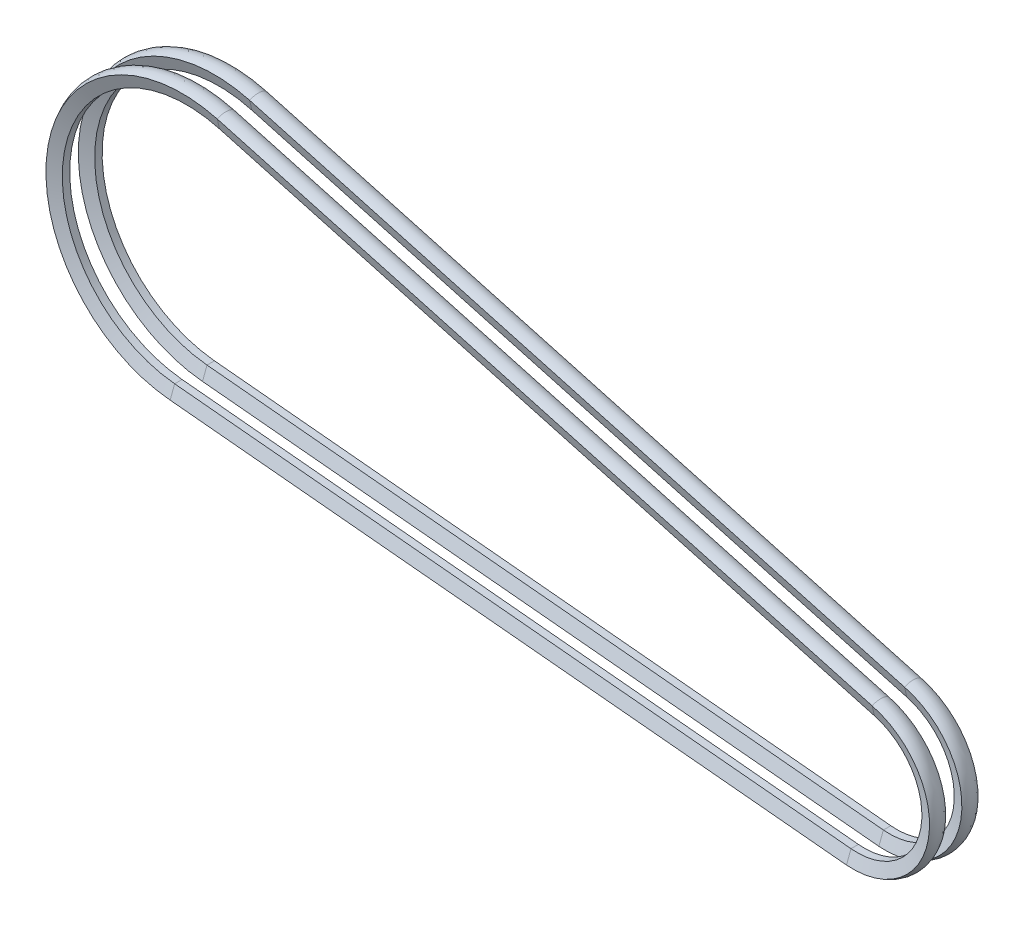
ISO-10303-21;
HEADER;
FILE_DESCRIPTION(('STEP AP214'),'2;1');
FILE_NAME('part.step','',(''),(''),'','','');
FILE_SCHEMA(('AUTOMOTIVE_DESIGN { 1 0 10303 214 1 1 1 1 }'));
ENDSEC;
DATA;
#1=APPLICATION_CONTEXT('core data for automotive mechanical design processes');
#2=APPLICATION_PROTOCOL_DEFINITION('international standard','automotive_design',2000,#1);
#3=PRODUCT_CONTEXT('',#1,'mechanical');
#4=PRODUCT('Part','Part','',(#3));
#5=PRODUCT_RELATED_PRODUCT_CATEGORY('part','',(#4));
#6=PRODUCT_DEFINITION_FORMATION('','',#4);
#7=PRODUCT_DEFINITION_CONTEXT('part definition',#1,'design');
#8=PRODUCT_DEFINITION('design','',#6,#7);
#9=PRODUCT_DEFINITION_SHAPE('','',#8);
#10=(LENGTH_UNIT() NAMED_UNIT(*) SI_UNIT(.MILLI.,.METRE.));
#11=(NAMED_UNIT(*) PLANE_ANGLE_UNIT() SI_UNIT($,.RADIAN.));
#12=(NAMED_UNIT(*) SI_UNIT($,.STERADIAN.) SOLID_ANGLE_UNIT());
#13=UNCERTAINTY_MEASURE_WITH_UNIT(LENGTH_MEASURE(1.E-05),#10,'distance_accuracy_value','');
#14=(GEOMETRIC_REPRESENTATION_CONTEXT(3) GLOBAL_UNCERTAINTY_ASSIGNED_CONTEXT((#13)) GLOBAL_UNIT_ASSIGNED_CONTEXT((#10,
#11,#12)) REPRESENTATION_CONTEXT('',''));
#15=CARTESIAN_POINT('',(0.,0.,0.));
#16=DIRECTION('',(0.,0.,1.));
#17=DIRECTION('',(1.,0.,0.));
#18=AXIS2_PLACEMENT_3D('',#15,#16,#17);
#19=DIRECTION('',(0.00737041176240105,0.939663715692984,0.342020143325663));
#20=VECTOR('',#19,1.);
#21=CARTESIAN_POINT('',(-6.19056546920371,-75.6646933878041,-24.0313623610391));
#22=LINE('',#21,#20);
#23=CARTESIAN_POINT('',(0.,0.,0.));
#24=DIRECTION('',(0.,0.,1.));
#25=AXIS1_PLACEMENT('',#23,#24);
#26=SURFACE_OF_REVOLUTION('',#22,#25);
#27=CARTESIAN_POINT('',(-6.19056546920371,-75.6646933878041,-24.0313623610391));
#28=VERTEX_POINT('',#27);
#29=CARTESIAN_POINT('',(-6.0971796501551,-63.7588096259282,-19.6978417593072));
#30=VERTEX_POINT('',#29);
#31=EDGE_CURVE('P0_E176',#28,#30,#22,.T.);
#32=ORIENTED_EDGE('',*,*,#31,.T.);
#33=CARTESIAN_POINT('',(0.,0.,-19.6978417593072));
#34=DIRECTION('',(0.,0.,1.));
#35=DIRECTION('',(1.,0.,0.));
#36=AXIS2_PLACEMENT_3D('',#33,#34,#35);
#37=CIRCLE('',#36,64.0496791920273);
#38=CARTESIAN_POINT('',(17.06330276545,61.7349585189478,-19.6978417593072));
#39=VERTEX_POINT('',#38);
#40=EDGE_CURVE('P0_E26',#30,#39,#37,.T.);
#41=ORIENTED_EDGE('',*,*,#40,.T.);
#42=DIRECTION('',(-0.170236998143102,-0.92414370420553,0.342020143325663));
#43=VECTOR('',#42,1.);
#44=CARTESIAN_POINT('',(19.2202679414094,73.4441980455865,-24.0313623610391));
#45=LINE('',#44,#43);
#46=CARTESIAN_POINT('',(19.2202679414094,73.4441980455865,-24.0313623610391));
#47=VERTEX_POINT('',#46);
#48=EDGE_CURVE('P0_E146',#47,#39,#45,.T.);
#49=ORIENTED_EDGE('',*,*,#48,.F.);
#50=CARTESIAN_POINT('',(0.,0.,-24.0313623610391));
#51=DIRECTION('',(0.,0.,1.));
#52=DIRECTION('',(1.,0.,0.));
#53=AXIS2_PLACEMENT_3D('',#50,#51,#52);
#54=CIRCLE('',#53,75.9175139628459);
#55=EDGE_CURVE('P0_E11',#28,#47,#54,.T.);
#56=ORIENTED_EDGE('',*,*,#55,.F.);
#57=EDGE_LOOP('',(#32,#41,#49,#56));
#58=FACE_BOUND('',#57,.T.);
#59=ADVANCED_FACE('P0_F17',(#58),#26,.F.);
#60=CARTESIAN_POINT('',(0.,0.,0.));
#61=DIRECTION('',(0.,0.,1.));
#62=DIRECTION('',(1.,0.,0.));
#63=AXIS2_PLACEMENT_3D('',#60,#61,#62);
#64=CYLINDRICAL_SURFACE('',#63,64.0496791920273);
#65=DIRECTION('',(0.,0.,1.));
#66=VECTOR('',#65,1.);
#67=CARTESIAN_POINT('',(-6.0971796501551,-63.7588096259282,-19.6978417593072));
#68=LINE('',#67,#66);
#69=CARTESIAN_POINT('',(-6.0971796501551,-63.7588096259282,-12.3439747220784));
#70=VERTEX_POINT('',#69);
#71=EDGE_CURVE('P0_E158',#30,#70,#68,.T.);
#72=ORIENTED_EDGE('',*,*,#71,.T.);
#73=CARTESIAN_POINT('',(0.,0.,-12.3439747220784));
#74=DIRECTION('',(0.,0.,1.));
#75=DIRECTION('',(1.,0.,0.));
#76=AXIS2_PLACEMENT_3D('',#73,#74,#75);
#77=CIRCLE('',#76,64.0496791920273);
#78=CARTESIAN_POINT('',(17.06330276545,61.7349585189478,-12.3439747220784));
#79=VERTEX_POINT('',#78);
#80=EDGE_CURVE('P0_E152',#70,#79,#77,.T.);
#81=ORIENTED_EDGE('',*,*,#80,.T.);
#82=DIRECTION('',(0.,0.,1.));
#83=VECTOR('',#82,1.);
#84=CARTESIAN_POINT('',(17.06330276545,61.7349585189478,-19.6978417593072));
#85=LINE('',#84,#83);
#86=EDGE_CURVE('P0_E141',#39,#79,#85,.T.);
#87=ORIENTED_EDGE('',*,*,#86,.F.);
#88=ORIENTED_EDGE('',*,*,#40,.F.);
#89=EDGE_LOOP('',(#72,#81,#87,#88));
#90=FACE_BOUND('',#89,.T.);
#91=ADVANCED_FACE('P0_F156',(#90),#64,.F.);
#92=DIRECTION('',(-0.00737041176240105,-0.939663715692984,0.342020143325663));
#93=VECTOR('',#92,1.);
#94=CARTESIAN_POINT('',(-6.0971796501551,-63.7588096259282,-12.3439747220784));
#95=LINE('',#94,#93);
#96=CARTESIAN_POINT('',(0.,0.,0.));
#97=DIRECTION('',(0.,0.,1.));
#98=AXIS1_PLACEMENT('',#96,#97);
#99=SURFACE_OF_REVOLUTION('',#95,#98);
#100=CARTESIAN_POINT('',(-6.19056546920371,-75.6646933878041,-8.01045412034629));
#101=VERTEX_POINT('',#100);
#102=EDGE_CURVE('P0_E181',#70,#101,#95,.T.);
#103=ORIENTED_EDGE('',*,*,#102,.T.);
#104=CARTESIAN_POINT('',(0.,0.,-8.01045412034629));
#105=DIRECTION('',(0.,0.,1.));
#106=DIRECTION('',(1.,0.,0.));
#107=AXIS2_PLACEMENT_3D('',#104,#105,#106);
#108=CIRCLE('',#107,75.9175139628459);
#109=CARTESIAN_POINT('',(19.2202679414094,73.4441980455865,-8.01045412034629));
#110=VERTEX_POINT('',#109);
#111=EDGE_CURVE('P0_E154',#101,#110,#108,.T.);
#112=ORIENTED_EDGE('',*,*,#111,.T.);
#113=DIRECTION('',(0.170236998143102,0.92414370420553,0.342020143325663));
#114=VECTOR('',#113,1.);
#115=CARTESIAN_POINT('',(17.06330276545,61.7349585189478,-12.3439747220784));
#116=LINE('',#115,#114);
#117=EDGE_CURVE('P0_E139',#79,#110,#116,.T.);
#118=ORIENTED_EDGE('',*,*,#117,.F.);
#119=ORIENTED_EDGE('',*,*,#80,.F.);
#120=EDGE_LOOP('',(#103,#112,#118,#119));
#121=FACE_BOUND('',#120,.T.);
#122=ADVANCED_FACE('P0_F151',(#121),#99,.F.);
#123=CARTESIAN_POINT('',(-6.0971796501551,-63.7588096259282,-16.0209082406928));
#124=DIRECTION('',(0.999969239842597,-0.00784342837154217,0.));
#125=DIRECTION('',(-0.00784342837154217,-0.999969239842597,0.));
#126=AXIS2_PLACEMENT_3D('',#123,#124,#125);
#127=CIRCLE('',#126,14.3501276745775);
#128=CARTESIAN_POINT('',(0.,0.,0.));
#129=DIRECTION('',(0.,0.,1.));
#130=AXIS1_PLACEMENT('',#128,#129);
#131=SURFACE_OF_REVOLUTION('',#127,#130);
#132=EDGE_CURVE('P0_E97',#101,#28,#127,.T.);
#133=ORIENTED_EDGE('',*,*,#132,.T.);
#134=ORIENTED_EDGE('',*,*,#55,.T.);
#135=CARTESIAN_POINT('',(17.06330276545,61.7349585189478,-16.0209082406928));
#136=DIRECTION('',(-0.983453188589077,0.181162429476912,0.));
#137=DIRECTION('',(0.181162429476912,0.983453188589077,0.));
#138=AXIS2_PLACEMENT_3D('',#135,#136,#137);
#139=CIRCLE('',#138,14.3501276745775);
#140=EDGE_CURVE('P0_E113',#110,#47,#139,.T.);
#141=ORIENTED_EDGE('',*,*,#140,.F.);
#142=ORIENTED_EDGE('',*,*,#111,.F.);
#143=EDGE_LOOP('',(#133,#134,#141,#142));
#144=FACE_BOUND('',#143,.T.);
#145=ADVANCED_FACE('P0_F188',(#144),#131,.F.);
#146=CARTESIAN_POINT('',(-675.337583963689,-11.8998067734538,-24.0313623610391));
#147=DIRECTION('',(0.0325541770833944,0.341622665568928,-0.939273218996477));
#148=DIRECTION('',(0.,0.939771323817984,0.341803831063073));
#149=AXIS2_PLACEMENT_3D('',#146,#147,#148);
#150=PLANE('',#149);
#151=DIRECTION('',(0.00737041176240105,0.939663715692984,0.342020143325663));
#152=VECTOR('',#151,1.);
#153=CARTESIAN_POINT('',(-675.337583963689,-11.8998067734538,-24.0313623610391));
#154=LINE('',#153,#152);
#155=CARTESIAN_POINT('',(-675.337583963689,-11.8998067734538,-24.0313623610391));
#156=VERTEX_POINT('',#155);
#157=CARTESIAN_POINT('',(-675.24419814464,0.00607698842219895,-19.6978417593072));
#158=VERTEX_POINT('',#157);
#159=EDGE_CURVE('P0_E94',#156,#158,#154,.T.);
#160=ORIENTED_EDGE('',*,*,#159,.T.);
#161=DIRECTION('',(0.995490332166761,-0.0948630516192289,0.));
#162=VECTOR('',#161,1.);
#163=CARTESIAN_POINT('',(-675.24419814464,0.00607698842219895,-19.6978417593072));
#164=LINE('',#163,#162);
#165=EDGE_CURVE('P0_E168',#158,#30,#164,.T.);
#166=ORIENTED_EDGE('',*,*,#165,.T.);
#167=ORIENTED_EDGE('',*,*,#31,.F.);
#168=DIRECTION('',(0.995490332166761,-0.0948630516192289,0.));
#169=VECTOR('',#168,1.);
#170=CARTESIAN_POINT('',(-675.337583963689,-11.8998067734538,-24.0313623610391));
#171=LINE('',#170,#169);
#172=EDGE_CURVE('P0_E165',#156,#28,#171,.T.);
#173=ORIENTED_EDGE('',*,*,#172,.F.);
#174=EDGE_LOOP('',(#160,#166,#167,#173));
#175=FACE_BOUND('',#174,.T.);
#176=ADVANCED_FACE('P0_F206',(#175),#150,.T.);
#177=CARTESIAN_POINT('',(-675.24419814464,0.00607698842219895,-19.6978417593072));
#178=DIRECTION('',(0.0948630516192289,0.995490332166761,0.));
#179=DIRECTION('',(-0.995490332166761,0.0948630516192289,0.));
#180=AXIS2_PLACEMENT_3D('',#177,#178,#179);
#181=PLANE('',#180);
#182=DIRECTION('',(0.,0.,1.));
#183=VECTOR('',#182,1.);
#184=CARTESIAN_POINT('',(-675.24419814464,0.00607698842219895,-19.6978417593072));
#185=LINE('',#184,#183);
#186=CARTESIAN_POINT('',(-675.24419814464,0.00607698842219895,-12.3439747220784));
#187=VERTEX_POINT('',#186);
#188=EDGE_CURVE('P0_E208',#158,#187,#185,.T.);
#189=ORIENTED_EDGE('',*,*,#188,.T.);
#190=DIRECTION('',(0.995490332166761,-0.0948630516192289,0.));
#191=VECTOR('',#190,1.);
#192=CARTESIAN_POINT('',(-675.24419814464,0.00607698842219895,-12.3439747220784));
#193=LINE('',#192,#191);
#194=EDGE_CURVE('P0_E171',#187,#70,#193,.T.);
#195=ORIENTED_EDGE('',*,*,#194,.T.);
#196=ORIENTED_EDGE('',*,*,#71,.F.);
#197=ORIENTED_EDGE('',*,*,#165,.F.);
#198=EDGE_LOOP('',(#189,#195,#196,#197));
#199=FACE_BOUND('',#198,.T.);
#200=ADVANCED_FACE('P0_F205',(#199),#181,.T.);
#201=CARTESIAN_POINT('',(-675.24419814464,0.00607698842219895,-12.3439747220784));
#202=DIRECTION('',(0.0325541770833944,0.341622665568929,0.939273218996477));
#203=DIRECTION('',(0.,-0.939771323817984,0.341803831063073));
#204=AXIS2_PLACEMENT_3D('',#201,#202,#203);
#205=PLANE('',#204);
#206=DIRECTION('',(-0.00737041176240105,-0.939663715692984,0.342020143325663));
#207=VECTOR('',#206,1.);
#208=CARTESIAN_POINT('',(-675.24419814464,0.00607698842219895,-12.3439747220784));
#209=LINE('',#208,#207);
#210=CARTESIAN_POINT('',(-675.337583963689,-11.8998067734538,-8.01045412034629));
#211=VERTEX_POINT('',#210);
#212=EDGE_CURVE('P0_E118',#187,#211,#209,.T.);
#213=ORIENTED_EDGE('',*,*,#212,.T.);
#214=DIRECTION('',(0.995490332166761,-0.0948630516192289,0.));
#215=VECTOR('',#214,1.);
#216=CARTESIAN_POINT('',(-675.337583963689,-11.8998067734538,-8.01045412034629));
#217=LINE('',#216,#215);
#218=EDGE_CURVE('P0_E174',#211,#101,#217,.T.);
#219=ORIENTED_EDGE('',*,*,#218,.T.);
#220=ORIENTED_EDGE('',*,*,#102,.F.);
#221=ORIENTED_EDGE('',*,*,#194,.F.);
#222=EDGE_LOOP('',(#213,#219,#220,#221));
#223=FACE_BOUND('',#222,.T.);
#224=ADVANCED_FACE('P0_F231',(#223),#205,.T.);
#225=CARTESIAN_POINT('',(-675.24419814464,0.00607698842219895,-16.0209082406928));
#226=DIRECTION('',(0.999969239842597,-0.00784342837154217,0.));
#227=DIRECTION('',(-0.00784342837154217,-0.999969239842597,0.));
#228=AXIS2_PLACEMENT_3D('',#225,#226,#227);
#229=CIRCLE('',#228,14.3501276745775);
#230=DIRECTION('',(0.995490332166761,-0.0948630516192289,0.));
#231=VECTOR('',#230,1.);
#232=SURFACE_OF_LINEAR_EXTRUSION('',#229,#231);
#233=EDGE_CURVE('P0_E115',#211,#156,#229,.T.);
#234=ORIENTED_EDGE('',*,*,#233,.T.);
#235=ORIENTED_EDGE('',*,*,#172,.T.);
#236=ORIENTED_EDGE('',*,*,#132,.F.);
#237=ORIENTED_EDGE('',*,*,#218,.F.);
#238=EDGE_LOOP('',(#234,#235,#236,#237));
#239=FACE_BOUND('',#238,.T.);
#240=ADVANCED_FACE('P0_F227',(#239),#232,.T.);
#241=DIRECTION('',(-0.170236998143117,-0.924143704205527,0.342020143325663));
#242=VECTOR('',#241,1.);
#243=CARTESIAN_POINT('',(-628.725485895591,252.301664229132,-24.0313623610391));
#244=LINE('',#243,#242);
#245=CARTESIAN_POINT('',(-663.575000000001,122.237499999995,0.));
#246=DIRECTION('',(0.,0.,1.));
#247=AXIS1_PLACEMENT('',#245,#246);
#248=SURFACE_OF_REVOLUTION('',#244,#247);
#249=CARTESIAN_POINT('',(-628.725485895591,252.301664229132,-24.0313623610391));
#250=VERTEX_POINT('',#249);
#251=CARTESIAN_POINT('',(-630.882451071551,240.592424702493,-19.6978417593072));
#252=VERTEX_POINT('',#251);
#253=EDGE_CURVE('P0_E92',#250,#252,#244,.T.);
#254=ORIENTED_EDGE('',*,*,#253,.T.);
#255=CARTESIAN_POINT('',(-663.575000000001,122.237499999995,-19.6978417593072));
#256=DIRECTION('',(0.,0.,1.));
#257=DIRECTION('',(1.,0.,0.));
#258=AXIS2_PLACEMENT_3D('',#255,#256,#257);
#259=CIRCLE('',#258,122.787177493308);
#260=EDGE_CURVE('P0_E98',#252,#158,#259,.T.);
#261=ORIENTED_EDGE('',*,*,#260,.T.);
#262=ORIENTED_EDGE('',*,*,#159,.F.);
#263=CARTESIAN_POINT('',(-663.575000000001,122.237499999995,-24.0313623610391));
#264=DIRECTION('',(0.,0.,1.));
#265=DIRECTION('',(1.,0.,0.));
#266=AXIS2_PLACEMENT_3D('',#263,#264,#265);
#267=CIRCLE('',#266,134.65205327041);
#268=EDGE_CURVE('P0_E88',#250,#156,#267,.T.);
#269=ORIENTED_EDGE('',*,*,#268,.F.);
#270=EDGE_LOOP('',(#254,#261,#262,#269));
#271=FACE_BOUND('',#270,.T.);
#272=ADVANCED_FACE('P0_F90',(#271),#248,.F.);
#273=CARTESIAN_POINT('',(-663.575000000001,122.237499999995,0.));
#274=DIRECTION('',(0.,0.,1.));
#275=DIRECTION('',(1.,0.,0.));
#276=AXIS2_PLACEMENT_3D('',#273,#274,#275);
#277=CYLINDRICAL_SURFACE('',#276,122.787177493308);
#278=DIRECTION('',(0.,0.,1.));
#279=VECTOR('',#278,1.);
#280=CARTESIAN_POINT('',(-630.882451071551,240.592424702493,-19.6978417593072));
#281=LINE('',#280,#279);
#282=CARTESIAN_POINT('',(-630.882451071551,240.592424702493,-12.3439747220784));
#283=VERTEX_POINT('',#282);
#284=EDGE_CURVE('P0_E109',#252,#283,#281,.T.);
#285=ORIENTED_EDGE('',*,*,#284,.T.);
#286=CARTESIAN_POINT('',(-663.575000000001,122.237499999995,-12.3439747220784));
#287=DIRECTION('',(0.,0.,1.));
#288=DIRECTION('',(1.,0.,0.));
#289=AXIS2_PLACEMENT_3D('',#286,#287,#288);
#290=CIRCLE('',#289,122.787177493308);
#291=EDGE_CURVE('P0_E214',#283,#187,#290,.T.);
#292=ORIENTED_EDGE('',*,*,#291,.T.);
#293=ORIENTED_EDGE('',*,*,#188,.F.);
#294=ORIENTED_EDGE('',*,*,#260,.F.);
#295=EDGE_LOOP('',(#285,#292,#293,#294));
#296=FACE_BOUND('',#295,.T.);
#297=ADVANCED_FACE('P0_F213',(#296),#277,.F.);
#298=DIRECTION('',(0.170236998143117,0.924143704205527,0.342020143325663));
#299=VECTOR('',#298,1.);
#300=CARTESIAN_POINT('',(-630.882451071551,240.592424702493,-12.3439747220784));
#301=LINE('',#300,#299);
#302=CARTESIAN_POINT('',(-663.575000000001,122.237499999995,0.));
#303=DIRECTION('',(0.,0.,1.));
#304=AXIS1_PLACEMENT('',#302,#303);
#305=SURFACE_OF_REVOLUTION('',#301,#304);
#306=CARTESIAN_POINT('',(-628.725485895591,252.301664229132,-8.01045412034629));
#307=VERTEX_POINT('',#306);
#308=EDGE_CURVE('P0_E128',#283,#307,#301,.T.);
#309=ORIENTED_EDGE('',*,*,#308,.T.);
#310=CARTESIAN_POINT('',(-663.575000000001,122.237499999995,-8.01045412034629));
#311=DIRECTION('',(0.,0.,1.));
#312=DIRECTION('',(1.,0.,0.));
#313=AXIS2_PLACEMENT_3D('',#310,#311,#312);
#314=CIRCLE('',#313,134.65205327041);
#315=EDGE_CURVE('P0_E104',#307,#211,#314,.T.);
#316=ORIENTED_EDGE('',*,*,#315,.T.);
#317=ORIENTED_EDGE('',*,*,#212,.F.);
#318=ORIENTED_EDGE('',*,*,#291,.F.);
#319=EDGE_LOOP('',(#309,#316,#317,#318));
#320=FACE_BOUND('',#319,.T.);
#321=ADVANCED_FACE('P0_F249',(#320),#305,.F.);
#322=CARTESIAN_POINT('',(-630.882451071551,240.592424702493,-16.0209082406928));
#323=DIRECTION('',(-0.983453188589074,0.181162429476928,0.));
#324=DIRECTION('',(0.181162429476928,0.983453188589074,0.));
#325=AXIS2_PLACEMENT_3D('',#322,#323,#324);
#326=CIRCLE('',#325,14.3501276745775);
#327=CARTESIAN_POINT('',(-663.575000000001,122.237499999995,0.));
#328=DIRECTION('',(0.,0.,1.));
#329=AXIS1_PLACEMENT('',#327,#328);
#330=SURFACE_OF_REVOLUTION('',#326,#329);
#331=EDGE_CURVE('P0_E101',#307,#250,#326,.T.);
#332=ORIENTED_EDGE('',*,*,#331,.T.);
#333=ORIENTED_EDGE('',*,*,#268,.T.);
#334=ORIENTED_EDGE('',*,*,#233,.F.);
#335=ORIENTED_EDGE('',*,*,#315,.F.);
#336=EDGE_LOOP('',(#332,#333,#334,#335));
#337=FACE_BOUND('',#336,.T.);
#338=ADVANCED_FACE('P0_F102',(#337),#330,.F.);
#339=DIRECTION('',(0.963949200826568,-0.266086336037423,0.));
#340=VECTOR('',#339,1.);
#341=SURFACE_OF_LINEAR_EXTRUSION('',#326,#340);
#342=DIRECTION('',(0.963949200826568,-0.266086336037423,0.));
#343=VECTOR('',#342,1.);
#344=CARTESIAN_POINT('',(-628.725485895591,252.301664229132,-8.01045412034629));
#345=LINE('',#344,#343);
#346=EDGE_CURVE('P0_E126',#307,#110,#345,.T.);
#347=ORIENTED_EDGE('',*,*,#346,.T.);
#348=ORIENTED_EDGE('',*,*,#140,.T.);
#349=DIRECTION('',(0.963949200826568,-0.266086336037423,0.));
#350=VECTOR('',#349,1.);
#351=CARTESIAN_POINT('',(-628.725485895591,252.301664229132,-24.0313623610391));
#352=LINE('',#351,#350);
#353=EDGE_CURVE('P0_E34',#250,#47,#352,.T.);
#354=ORIENTED_EDGE('',*,*,#353,.F.);
#355=ORIENTED_EDGE('',*,*,#331,.F.);
#356=EDGE_LOOP('',(#347,#348,#354,#355));
#357=FACE_BOUND('',#356,.T.);
#358=ADVANCED_FACE('P0_F111',(#357),#341,.F.);
#359=CARTESIAN_POINT('',(-628.725485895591,252.301664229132,-24.0313623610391));
#360=DIRECTION('',(0.0913129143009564,0.33079868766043,0.939273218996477));
#361=DIRECTION('',(0.,-0.943213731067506,0.332186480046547));
#362=AXIS2_PLACEMENT_3D('',#359,#360,#361);
#363=PLANE('',#362);
#364=ORIENTED_EDGE('',*,*,#353,.T.);
#365=ORIENTED_EDGE('',*,*,#48,.T.);
#366=DIRECTION('',(0.963949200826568,-0.266086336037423,0.));
#367=VECTOR('',#366,1.);
#368=CARTESIAN_POINT('',(-630.882451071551,240.592424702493,-19.6978417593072));
#369=LINE('',#368,#367);
#370=EDGE_CURVE('P0_E42',#252,#39,#369,.T.);
#371=ORIENTED_EDGE('',*,*,#370,.F.);
#372=ORIENTED_EDGE('',*,*,#253,.F.);
#373=EDGE_LOOP('',(#364,#365,#371,#372));
#374=FACE_BOUND('',#373,.T.);
#375=ADVANCED_FACE('P0_F108',(#374),#363,.F.);
#376=CARTESIAN_POINT('',(-630.882451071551,240.592424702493,-19.6978417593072));
#377=DIRECTION('',(0.266086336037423,0.963949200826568,0.));
#378=DIRECTION('',(-0.963949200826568,0.266086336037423,0.));
#379=AXIS2_PLACEMENT_3D('',#376,#377,#378);
#380=PLANE('',#379);
#381=ORIENTED_EDGE('',*,*,#370,.T.);
#382=ORIENTED_EDGE('',*,*,#86,.T.);
#383=DIRECTION('',(0.963949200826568,-0.266086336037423,0.));
#384=VECTOR('',#383,1.);
#385=CARTESIAN_POINT('',(-630.882451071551,240.592424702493,-12.3439747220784));
#386=LINE('',#385,#384);
#387=EDGE_CURVE('P0_E120',#283,#79,#386,.T.);
#388=ORIENTED_EDGE('',*,*,#387,.F.);
#389=ORIENTED_EDGE('',*,*,#284,.F.);
#390=EDGE_LOOP('',(#381,#382,#388,#389));
#391=FACE_BOUND('',#390,.T.);
#392=ADVANCED_FACE('P0_F142',(#391),#380,.F.);
#393=CARTESIAN_POINT('',(-630.882451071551,240.592424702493,-12.3439747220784));
#394=DIRECTION('',(0.0913129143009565,0.330798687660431,-0.939273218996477));
#395=DIRECTION('',(0.,0.943213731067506,0.332186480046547));
#396=AXIS2_PLACEMENT_3D('',#393,#394,#395);
#397=PLANE('',#396);
#398=ORIENTED_EDGE('',*,*,#387,.T.);
#399=ORIENTED_EDGE('',*,*,#117,.T.);
#400=ORIENTED_EDGE('',*,*,#346,.F.);
#401=ORIENTED_EDGE('',*,*,#308,.F.);
#402=EDGE_LOOP('',(#398,#399,#400,#401));
#403=FACE_BOUND('',#402,.T.);
#404=ADVANCED_FACE('P0_F136',(#403),#397,.F.);
#405=CLOSED_SHELL('',(#59,#91,#122,#145,#176,#200,#224,#240,#272,#297,#321,#338,#358,#375,#392,#404));
#406=MANIFOLD_SOLID_BREP('P0_B1',#405);
#407=DIRECTION('',(0.00737041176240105,0.939663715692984,0.342020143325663));
#408=VECTOR('',#407,1.);
#409=CARTESIAN_POINT('',(-6.0971796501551,-63.7588096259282,12.3439747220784));
#410=LINE('',#409,#408);
#411=CARTESIAN_POINT('',(0.,0.,0.));
#412=DIRECTION('',(0.,0.,1.));
#413=AXIS1_PLACEMENT('',#411,#412);
#414=SURFACE_OF_REVOLUTION('',#410,#413);
#415=CARTESIAN_POINT('',(-6.19056546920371,-75.6646933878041,8.01045412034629));
#416=VERTEX_POINT('',#415);
#417=CARTESIAN_POINT('',(-6.0971796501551,-63.7588096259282,12.3439747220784));
#418=VERTEX_POINT('',#417);
#419=EDGE_CURVE('P1_E176',#416,#418,#410,.T.);
#420=ORIENTED_EDGE('',*,*,#419,.T.);
#421=CARTESIAN_POINT('',(0.,0.,12.3439747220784));
#422=DIRECTION('',(0.,0.,1.));
#423=DIRECTION('',(1.,0.,0.));
#424=AXIS2_PLACEMENT_3D('',#421,#422,#423);
#425=CIRCLE('',#424,64.0496791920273);
#426=CARTESIAN_POINT('',(17.06330276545,61.7349585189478,12.3439747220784));
#427=VERTEX_POINT('',#426);
#428=EDGE_CURVE('P1_E26',#418,#427,#425,.T.);
#429=ORIENTED_EDGE('',*,*,#428,.T.);
#430=DIRECTION('',(-0.170236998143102,-0.92414370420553,0.342020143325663));
#431=VECTOR('',#430,1.);
#432=CARTESIAN_POINT('',(17.06330276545,61.7349585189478,12.3439747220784));
#433=LINE('',#432,#431);
#434=CARTESIAN_POINT('',(19.2202679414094,73.4441980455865,8.01045412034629));
#435=VERTEX_POINT('',#434);
#436=EDGE_CURVE('P1_E146',#435,#427,#433,.T.);
#437=ORIENTED_EDGE('',*,*,#436,.F.);
#438=CARTESIAN_POINT('',(0.,0.,8.01045412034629));
#439=DIRECTION('',(0.,0.,1.));
#440=DIRECTION('',(1.,0.,0.));
#441=AXIS2_PLACEMENT_3D('',#438,#439,#440);
#442=CIRCLE('',#441,75.9175139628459);
#443=EDGE_CURVE('P1_E11',#416,#435,#442,.T.);
#444=ORIENTED_EDGE('',*,*,#443,.F.);
#445=EDGE_LOOP('',(#420,#429,#437,#444));
#446=FACE_BOUND('',#445,.T.);
#447=ADVANCED_FACE('P1_F17',(#446),#414,.F.);
#448=CARTESIAN_POINT('',(0.,0.,0.));
#449=DIRECTION('',(0.,0.,1.));
#450=DIRECTION('',(1.,0.,0.));
#451=AXIS2_PLACEMENT_3D('',#448,#449,#450);
#452=CYLINDRICAL_SURFACE('',#451,64.0496791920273);
#453=DIRECTION('',(0.,0.,1.));
#454=VECTOR('',#453,1.);
#455=CARTESIAN_POINT('',(-6.0971796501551,-63.7588096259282,19.6978417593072));
#456=LINE('',#455,#454);
#457=CARTESIAN_POINT('',(-6.0971796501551,-63.7588096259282,19.6978417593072));
#458=VERTEX_POINT('',#457);
#459=EDGE_CURVE('P1_E158',#418,#458,#456,.T.);
#460=ORIENTED_EDGE('',*,*,#459,.T.);
#461=CARTESIAN_POINT('',(0.,0.,19.6978417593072));
#462=DIRECTION('',(0.,0.,1.));
#463=DIRECTION('',(1.,0.,0.));
#464=AXIS2_PLACEMENT_3D('',#461,#462,#463);
#465=CIRCLE('',#464,64.0496791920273);
#466=CARTESIAN_POINT('',(17.06330276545,61.7349585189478,19.6978417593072));
#467=VERTEX_POINT('',#466);
#468=EDGE_CURVE('P1_E152',#458,#467,#465,.T.);
#469=ORIENTED_EDGE('',*,*,#468,.T.);
#470=DIRECTION('',(0.,0.,1.));
#471=VECTOR('',#470,1.);
#472=CARTESIAN_POINT('',(17.06330276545,61.7349585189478,19.6978417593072));
#473=LINE('',#472,#471);
#474=EDGE_CURVE('P1_E141',#427,#467,#473,.T.);
#475=ORIENTED_EDGE('',*,*,#474,.F.);
#476=ORIENTED_EDGE('',*,*,#428,.F.);
#477=EDGE_LOOP('',(#460,#469,#475,#476));
#478=FACE_BOUND('',#477,.T.);
#479=ADVANCED_FACE('P1_F156',(#478),#452,.F.);
#480=DIRECTION('',(-0.00737041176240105,-0.939663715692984,0.342020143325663));
#481=VECTOR('',#480,1.);
#482=CARTESIAN_POINT('',(-6.19056546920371,-75.6646933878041,24.0313623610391));
#483=LINE('',#482,#481);
#484=CARTESIAN_POINT('',(0.,0.,0.));
#485=DIRECTION('',(0.,0.,1.));
#486=AXIS1_PLACEMENT('',#484,#485);
#487=SURFACE_OF_REVOLUTION('',#483,#486);
#488=CARTESIAN_POINT('',(-6.19056546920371,-75.6646933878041,24.0313623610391));
#489=VERTEX_POINT('',#488);
#490=EDGE_CURVE('P1_E181',#458,#489,#483,.T.);
#491=ORIENTED_EDGE('',*,*,#490,.T.);
#492=CARTESIAN_POINT('',(0.,0.,24.0313623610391));
#493=DIRECTION('',(0.,0.,1.));
#494=DIRECTION('',(1.,0.,0.));
#495=AXIS2_PLACEMENT_3D('',#492,#493,#494);
#496=CIRCLE('',#495,75.9175139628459);
#497=CARTESIAN_POINT('',(19.2202679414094,73.4441980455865,24.0313623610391));
#498=VERTEX_POINT('',#497);
#499=EDGE_CURVE('P1_E154',#489,#498,#496,.T.);
#500=ORIENTED_EDGE('',*,*,#499,.T.);
#501=DIRECTION('',(0.170236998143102,0.92414370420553,0.342020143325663));
#502=VECTOR('',#501,1.);
#503=CARTESIAN_POINT('',(19.2202679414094,73.4441980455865,24.0313623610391));
#504=LINE('',#503,#502);
#505=EDGE_CURVE('P1_E139',#467,#498,#504,.T.);
#506=ORIENTED_EDGE('',*,*,#505,.F.);
#507=ORIENTED_EDGE('',*,*,#468,.F.);
#508=EDGE_LOOP('',(#491,#500,#506,#507));
#509=FACE_BOUND('',#508,.T.);
#510=ADVANCED_FACE('P1_F151',(#509),#487,.F.);
#511=CARTESIAN_POINT('',(-6.0971796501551,-63.7588096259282,16.0209082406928));
#512=DIRECTION('',(0.999969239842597,-0.00784342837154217,0.));
#513=DIRECTION('',(0.00784342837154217,0.999969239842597,0.));
#514=AXIS2_PLACEMENT_3D('',#511,#512,#513);
#515=CIRCLE('',#514,14.3501276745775);
#516=CARTESIAN_POINT('',(0.,0.,0.));
#517=DIRECTION('',(0.,0.,1.));
#518=AXIS1_PLACEMENT('',#516,#517);
#519=SURFACE_OF_REVOLUTION('',#515,#518);
#520=EDGE_CURVE('P1_E97',#489,#416,#515,.T.);
#521=ORIENTED_EDGE('',*,*,#520,.T.);
#522=ORIENTED_EDGE('',*,*,#443,.T.);
#523=CARTESIAN_POINT('',(17.06330276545,61.7349585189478,16.0209082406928));
#524=DIRECTION('',(-0.983453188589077,0.181162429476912,0.));
#525=DIRECTION('',(-0.181162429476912,-0.983453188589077,0.));
#526=AXIS2_PLACEMENT_3D('',#523,#524,#525);
#527=CIRCLE('',#526,14.3501276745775);
#528=EDGE_CURVE('P1_E113',#498,#435,#527,.T.);
#529=ORIENTED_EDGE('',*,*,#528,.F.);
#530=ORIENTED_EDGE('',*,*,#499,.F.);
#531=EDGE_LOOP('',(#521,#522,#529,#530));
#532=FACE_BOUND('',#531,.T.);
#533=ADVANCED_FACE('P1_F188',(#532),#519,.F.);
#534=CARTESIAN_POINT('',(-675.24419814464,0.00607698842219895,12.3439747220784));
#535=DIRECTION('',(0.0325541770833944,0.341622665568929,-0.939273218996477));
#536=DIRECTION('',(0.,0.939771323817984,0.341803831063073));
#537=AXIS2_PLACEMENT_3D('',#534,#535,#536);
#538=PLANE('',#537);
#539=DIRECTION('',(0.00737041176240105,0.939663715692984,0.342020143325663));
#540=VECTOR('',#539,1.);
#541=CARTESIAN_POINT('',(-675.24419814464,0.00607698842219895,12.3439747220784));
#542=LINE('',#541,#540);
#543=CARTESIAN_POINT('',(-675.337583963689,-11.8998067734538,8.01045412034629));
#544=VERTEX_POINT('',#543);
#545=CARTESIAN_POINT('',(-675.24419814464,0.00607698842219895,12.3439747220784));
#546=VERTEX_POINT('',#545);
#547=EDGE_CURVE('P1_E94',#544,#546,#542,.T.);
#548=ORIENTED_EDGE('',*,*,#547,.T.);
#549=DIRECTION('',(0.995490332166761,-0.0948630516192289,0.));
#550=VECTOR('',#549,1.);
#551=CARTESIAN_POINT('',(-675.24419814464,0.00607698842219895,12.3439747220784));
#552=LINE('',#551,#550);
#553=EDGE_CURVE('P1_E168',#546,#418,#552,.T.);
#554=ORIENTED_EDGE('',*,*,#553,.T.);
#555=ORIENTED_EDGE('',*,*,#419,.F.);
#556=DIRECTION('',(0.995490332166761,-0.0948630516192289,0.));
#557=VECTOR('',#556,1.);
#558=CARTESIAN_POINT('',(-675.337583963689,-11.8998067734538,8.01045412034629));
#559=LINE('',#558,#557);
#560=EDGE_CURVE('P1_E165',#544,#416,#559,.T.);
#561=ORIENTED_EDGE('',*,*,#560,.F.);
#562=EDGE_LOOP('',(#548,#554,#555,#561));
#563=FACE_BOUND('',#562,.T.);
#564=ADVANCED_FACE('P1_F206',(#563),#538,.T.);
#565=CARTESIAN_POINT('',(-675.24419814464,0.00607698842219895,19.6978417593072));
#566=DIRECTION('',(0.0948630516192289,0.995490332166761,0.));
#567=DIRECTION('',(-0.995490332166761,0.0948630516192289,0.));
#568=AXIS2_PLACEMENT_3D('',#565,#566,#567);
#569=PLANE('',#568);
#570=DIRECTION('',(0.,0.,1.));
#571=VECTOR('',#570,1.);
#572=CARTESIAN_POINT('',(-675.24419814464,0.00607698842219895,19.6978417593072));
#573=LINE('',#572,#571);
#574=CARTESIAN_POINT('',(-675.24419814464,0.00607698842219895,19.6978417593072));
#575=VERTEX_POINT('',#574);
#576=EDGE_CURVE('P1_E208',#546,#575,#573,.T.);
#577=ORIENTED_EDGE('',*,*,#576,.T.);
#578=DIRECTION('',(0.995490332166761,-0.0948630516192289,0.));
#579=VECTOR('',#578,1.);
#580=CARTESIAN_POINT('',(-675.24419814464,0.00607698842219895,19.6978417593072));
#581=LINE('',#580,#579);
#582=EDGE_CURVE('P1_E171',#575,#458,#581,.T.);
#583=ORIENTED_EDGE('',*,*,#582,.T.);
#584=ORIENTED_EDGE('',*,*,#459,.F.);
#585=ORIENTED_EDGE('',*,*,#553,.F.);
#586=EDGE_LOOP('',(#577,#583,#584,#585));
#587=FACE_BOUND('',#586,.T.);
#588=ADVANCED_FACE('P1_F205',(#587),#569,.T.);
#589=CARTESIAN_POINT('',(-675.337583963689,-11.8998067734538,24.0313623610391));
#590=DIRECTION('',(0.0325541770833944,0.341622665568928,0.939273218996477));
#591=DIRECTION('',(0.,-0.939771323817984,0.341803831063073));
#592=AXIS2_PLACEMENT_3D('',#589,#590,#591);
#593=PLANE('',#592);
#594=DIRECTION('',(-0.00737041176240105,-0.939663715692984,0.342020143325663));
#595=VECTOR('',#594,1.);
#596=CARTESIAN_POINT('',(-675.337583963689,-11.8998067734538,24.0313623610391));
#597=LINE('',#596,#595);
#598=CARTESIAN_POINT('',(-675.337583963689,-11.8998067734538,24.0313623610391));
#599=VERTEX_POINT('',#598);
#600=EDGE_CURVE('P1_E118',#575,#599,#597,.T.);
#601=ORIENTED_EDGE('',*,*,#600,.T.);
#602=DIRECTION('',(0.995490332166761,-0.0948630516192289,0.));
#603=VECTOR('',#602,1.);
#604=CARTESIAN_POINT('',(-675.337583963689,-11.8998067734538,24.0313623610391));
#605=LINE('',#604,#603);
#606=EDGE_CURVE('P1_E174',#599,#489,#605,.T.);
#607=ORIENTED_EDGE('',*,*,#606,.T.);
#608=ORIENTED_EDGE('',*,*,#490,.F.);
#609=ORIENTED_EDGE('',*,*,#582,.F.);
#610=EDGE_LOOP('',(#601,#607,#608,#609));
#611=FACE_BOUND('',#610,.T.);
#612=ADVANCED_FACE('P1_F231',(#611),#593,.T.);
#613=CARTESIAN_POINT('',(-675.24419814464,0.00607698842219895,16.0209082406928));
#614=DIRECTION('',(0.999969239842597,-0.00784342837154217,0.));
#615=DIRECTION('',(0.00784342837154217,0.999969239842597,0.));
#616=AXIS2_PLACEMENT_3D('',#613,#614,#615);
#617=CIRCLE('',#616,14.3501276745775);
#618=DIRECTION('',(0.995490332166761,-0.0948630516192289,0.));
#619=VECTOR('',#618,1.);
#620=SURFACE_OF_LINEAR_EXTRUSION('',#617,#619);
#621=EDGE_CURVE('P1_E115',#599,#544,#617,.T.);
#622=ORIENTED_EDGE('',*,*,#621,.T.);
#623=ORIENTED_EDGE('',*,*,#560,.T.);
#624=ORIENTED_EDGE('',*,*,#520,.F.);
#625=ORIENTED_EDGE('',*,*,#606,.F.);
#626=EDGE_LOOP('',(#622,#623,#624,#625));
#627=FACE_BOUND('',#626,.T.);
#628=ADVANCED_FACE('P1_F227',(#627),#620,.T.);
#629=DIRECTION('',(-0.170236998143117,-0.924143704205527,0.342020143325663));
#630=VECTOR('',#629,1.);
#631=CARTESIAN_POINT('',(-630.882451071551,240.592424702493,12.3439747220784));
#632=LINE('',#631,#630);
#633=CARTESIAN_POINT('',(-663.575000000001,122.237499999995,0.));
#634=DIRECTION('',(0.,0.,1.));
#635=AXIS1_PLACEMENT('',#633,#634);
#636=SURFACE_OF_REVOLUTION('',#632,#635);
#637=CARTESIAN_POINT('',(-628.725485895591,252.301664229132,8.01045412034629));
#638=VERTEX_POINT('',#637);
#639=CARTESIAN_POINT('',(-630.882451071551,240.592424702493,12.3439747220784));
#640=VERTEX_POINT('',#639);
#641=EDGE_CURVE('P1_E92',#638,#640,#632,.T.);
#642=ORIENTED_EDGE('',*,*,#641,.T.);
#643=CARTESIAN_POINT('',(-663.575000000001,122.237499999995,12.3439747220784));
#644=DIRECTION('',(0.,0.,1.));
#645=DIRECTION('',(1.,0.,0.));
#646=AXIS2_PLACEMENT_3D('',#643,#644,#645);
#647=CIRCLE('',#646,122.787177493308);
#648=EDGE_CURVE('P1_E98',#640,#546,#647,.T.);
#649=ORIENTED_EDGE('',*,*,#648,.T.);
#650=ORIENTED_EDGE('',*,*,#547,.F.);
#651=CARTESIAN_POINT('',(-663.575000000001,122.237499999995,8.01045412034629));
#652=DIRECTION('',(0.,0.,1.));
#653=DIRECTION('',(1.,0.,0.));
#654=AXIS2_PLACEMENT_3D('',#651,#652,#653);
#655=CIRCLE('',#654,134.65205327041);
#656=EDGE_CURVE('P1_E88',#638,#544,#655,.T.);
#657=ORIENTED_EDGE('',*,*,#656,.F.);
#658=EDGE_LOOP('',(#642,#649,#650,#657));
#659=FACE_BOUND('',#658,.T.);
#660=ADVANCED_FACE('P1_F90',(#659),#636,.F.);
#661=CARTESIAN_POINT('',(-663.575000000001,122.237499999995,0.));
#662=DIRECTION('',(0.,0.,1.));
#663=DIRECTION('',(1.,0.,0.));
#664=AXIS2_PLACEMENT_3D('',#661,#662,#663);
#665=CYLINDRICAL_SURFACE('',#664,122.787177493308);
#666=DIRECTION('',(0.,0.,1.));
#667=VECTOR('',#666,1.);
#668=CARTESIAN_POINT('',(-630.882451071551,240.592424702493,19.6978417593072));
#669=LINE('',#668,#667);
#670=CARTESIAN_POINT('',(-630.882451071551,240.592424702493,19.6978417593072));
#671=VERTEX_POINT('',#670);
#672=EDGE_CURVE('P1_E109',#640,#671,#669,.T.);
#673=ORIENTED_EDGE('',*,*,#672,.T.);
#674=CARTESIAN_POINT('',(-663.575000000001,122.237499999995,19.6978417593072));
#675=DIRECTION('',(0.,0.,1.));
#676=DIRECTION('',(1.,0.,0.));
#677=AXIS2_PLACEMENT_3D('',#674,#675,#676);
#678=CIRCLE('',#677,122.787177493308);
#679=EDGE_CURVE('P1_E214',#671,#575,#678,.T.);
#680=ORIENTED_EDGE('',*,*,#679,.T.);
#681=ORIENTED_EDGE('',*,*,#576,.F.);
#682=ORIENTED_EDGE('',*,*,#648,.F.);
#683=EDGE_LOOP('',(#673,#680,#681,#682));
#684=FACE_BOUND('',#683,.T.);
#685=ADVANCED_FACE('P1_F213',(#684),#665,.F.);
#686=DIRECTION('',(0.170236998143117,0.924143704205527,0.342020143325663));
#687=VECTOR('',#686,1.);
#688=CARTESIAN_POINT('',(-628.725485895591,252.301664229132,24.0313623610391));
#689=LINE('',#688,#687);
#690=CARTESIAN_POINT('',(-663.575000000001,122.237499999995,0.));
#691=DIRECTION('',(0.,0.,1.));
#692=AXIS1_PLACEMENT('',#690,#691);
#693=SURFACE_OF_REVOLUTION('',#689,#692);
#694=CARTESIAN_POINT('',(-628.725485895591,252.301664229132,24.0313623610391));
#695=VERTEX_POINT('',#694);
#696=EDGE_CURVE('P1_E128',#671,#695,#689,.T.);
#697=ORIENTED_EDGE('',*,*,#696,.T.);
#698=CARTESIAN_POINT('',(-663.575000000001,122.237499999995,24.0313623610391));
#699=DIRECTION('',(0.,0.,1.));
#700=DIRECTION('',(1.,0.,0.));
#701=AXIS2_PLACEMENT_3D('',#698,#699,#700);
#702=CIRCLE('',#701,134.65205327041);
#703=EDGE_CURVE('P1_E104',#695,#599,#702,.T.);
#704=ORIENTED_EDGE('',*,*,#703,.T.);
#705=ORIENTED_EDGE('',*,*,#600,.F.);
#706=ORIENTED_EDGE('',*,*,#679,.F.);
#707=EDGE_LOOP('',(#697,#704,#705,#706));
#708=FACE_BOUND('',#707,.T.);
#709=ADVANCED_FACE('P1_F249',(#708),#693,.F.);
#710=CARTESIAN_POINT('',(-630.882451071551,240.592424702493,16.0209082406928));
#711=DIRECTION('',(-0.983453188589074,0.181162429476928,0.));
#712=DIRECTION('',(-0.181162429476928,-0.983453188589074,0.));
#713=AXIS2_PLACEMENT_3D('',#710,#711,#712);
#714=CIRCLE('',#713,14.3501276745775);
#715=CARTESIAN_POINT('',(-663.575000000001,122.237499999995,0.));
#716=DIRECTION('',(0.,0.,1.));
#717=AXIS1_PLACEMENT('',#715,#716);
#718=SURFACE_OF_REVOLUTION('',#714,#717);
#719=EDGE_CURVE('P1_E101',#695,#638,#714,.T.);
#720=ORIENTED_EDGE('',*,*,#719,.T.);
#721=ORIENTED_EDGE('',*,*,#656,.T.);
#722=ORIENTED_EDGE('',*,*,#621,.F.);
#723=ORIENTED_EDGE('',*,*,#703,.F.);
#724=EDGE_LOOP('',(#720,#721,#722,#723));
#725=FACE_BOUND('',#724,.T.);
#726=ADVANCED_FACE('P1_F102',(#725),#718,.F.);
#727=DIRECTION('',(0.963949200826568,-0.266086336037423,0.));
#728=VECTOR('',#727,1.);
#729=SURFACE_OF_LINEAR_EXTRUSION('',#714,#728);
#730=DIRECTION('',(0.963949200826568,-0.266086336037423,0.));
#731=VECTOR('',#730,1.);
#732=CARTESIAN_POINT('',(-628.725485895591,252.301664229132,24.0313623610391));
#733=LINE('',#732,#731);
#734=EDGE_CURVE('P1_E126',#695,#498,#733,.T.);
#735=ORIENTED_EDGE('',*,*,#734,.T.);
#736=ORIENTED_EDGE('',*,*,#528,.T.);
#737=DIRECTION('',(0.963949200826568,-0.266086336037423,0.));
#738=VECTOR('',#737,1.);
#739=CARTESIAN_POINT('',(-628.725485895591,252.301664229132,8.01045412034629));
#740=LINE('',#739,#738);
#741=EDGE_CURVE('P1_E34',#638,#435,#740,.T.);
#742=ORIENTED_EDGE('',*,*,#741,.F.);
#743=ORIENTED_EDGE('',*,*,#719,.F.);
#744=EDGE_LOOP('',(#735,#736,#742,#743));
#745=FACE_BOUND('',#744,.T.);
#746=ADVANCED_FACE('P1_F111',(#745),#729,.F.);
#747=CARTESIAN_POINT('',(-630.882451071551,240.592424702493,12.3439747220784));
#748=DIRECTION('',(0.0913129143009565,0.330798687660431,0.939273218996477));
#749=DIRECTION('',(0.,-0.943213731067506,0.332186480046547));
#750=AXIS2_PLACEMENT_3D('',#747,#748,#749);
#751=PLANE('',#750);
#752=ORIENTED_EDGE('',*,*,#741,.T.);
#753=ORIENTED_EDGE('',*,*,#436,.T.);
#754=DIRECTION('',(0.963949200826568,-0.266086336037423,0.));
#755=VECTOR('',#754,1.);
#756=CARTESIAN_POINT('',(-630.882451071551,240.592424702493,12.3439747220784));
#757=LINE('',#756,#755);
#758=EDGE_CURVE('P1_E42',#640,#427,#757,.T.);
#759=ORIENTED_EDGE('',*,*,#758,.F.);
#760=ORIENTED_EDGE('',*,*,#641,.F.);
#761=EDGE_LOOP('',(#752,#753,#759,#760));
#762=FACE_BOUND('',#761,.T.);
#763=ADVANCED_FACE('P1_F108',(#762),#751,.F.);
#764=CARTESIAN_POINT('',(-630.882451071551,240.592424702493,19.6978417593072));
#765=DIRECTION('',(0.266086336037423,0.963949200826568,0.));
#766=DIRECTION('',(-0.963949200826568,0.266086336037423,0.));
#767=AXIS2_PLACEMENT_3D('',#764,#765,#766);
#768=PLANE('',#767);
#769=ORIENTED_EDGE('',*,*,#758,.T.);
#770=ORIENTED_EDGE('',*,*,#474,.T.);
#771=DIRECTION('',(0.963949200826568,-0.266086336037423,0.));
#772=VECTOR('',#771,1.);
#773=CARTESIAN_POINT('',(-630.882451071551,240.592424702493,19.6978417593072));
#774=LINE('',#773,#772);
#775=EDGE_CURVE('P1_E120',#671,#467,#774,.T.);
#776=ORIENTED_EDGE('',*,*,#775,.F.);
#777=ORIENTED_EDGE('',*,*,#672,.F.);
#778=EDGE_LOOP('',(#769,#770,#776,#777));
#779=FACE_BOUND('',#778,.T.);
#780=ADVANCED_FACE('P1_F142',(#779),#768,.F.);
#781=CARTESIAN_POINT('',(-628.725485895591,252.301664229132,24.0313623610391));
#782=DIRECTION('',(0.0913129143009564,0.33079868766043,-0.939273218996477));
#783=DIRECTION('',(0.,0.943213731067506,0.332186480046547));
#784=AXIS2_PLACEMENT_3D('',#781,#782,#783);
#785=PLANE('',#784);
#786=ORIENTED_EDGE('',*,*,#775,.T.);
#787=ORIENTED_EDGE('',*,*,#505,.T.);
#788=ORIENTED_EDGE('',*,*,#734,.F.);
#789=ORIENTED_EDGE('',*,*,#696,.F.);
#790=EDGE_LOOP('',(#786,#787,#788,#789));
#791=FACE_BOUND('',#790,.T.);
#792=ADVANCED_FACE('P1_F136',(#791),#785,.F.);
#793=CLOSED_SHELL('',(#447,#479,#510,#533,#564,#588,#612,#628,#660,#685,#709,#726,#746,#763,
#780,#792));
#794=MANIFOLD_SOLID_BREP('P1_B1',#793);
#795=ADVANCED_BREP_SHAPE_REPRESENTATION('',(#18,#406,#794),#14);
#796=SHAPE_DEFINITION_REPRESENTATION(#9,#795);
ENDSEC;
END-ISO-10303-21;
